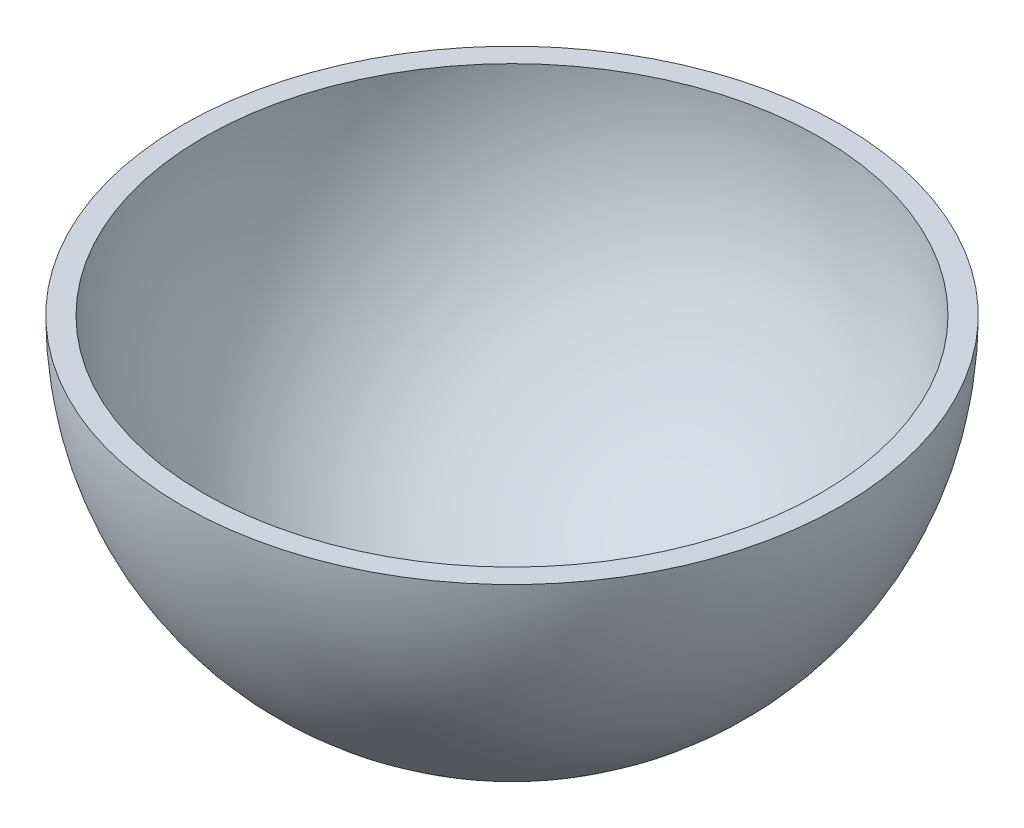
ISO-10303-21;
HEADER;
FILE_DESCRIPTION(('STEP AP214'),'2;1');
FILE_NAME('part.step','',(''),(''),'','','');
FILE_SCHEMA(('AUTOMOTIVE_DESIGN { 1 0 10303 214 1 1 1 1 }'));
ENDSEC;
DATA;
#1=APPLICATION_CONTEXT('core data for automotive mechanical design processes');
#2=APPLICATION_PROTOCOL_DEFINITION('international standard','automotive_design',2000,#1);
#3=PRODUCT_CONTEXT('',#1,'mechanical');
#4=PRODUCT('Part','Part','',(#3));
#5=PRODUCT_RELATED_PRODUCT_CATEGORY('part','',(#4));
#6=PRODUCT_DEFINITION_FORMATION('','',#4);
#7=PRODUCT_DEFINITION_CONTEXT('part definition',#1,'design');
#8=PRODUCT_DEFINITION('design','',#6,#7);
#9=PRODUCT_DEFINITION_SHAPE('','',#8);
#10=(LENGTH_UNIT() NAMED_UNIT(*) SI_UNIT(.MILLI.,.METRE.));
#11=(NAMED_UNIT(*) PLANE_ANGLE_UNIT() SI_UNIT($,.RADIAN.));
#12=(NAMED_UNIT(*) SI_UNIT($,.STERADIAN.) SOLID_ANGLE_UNIT());
#13=UNCERTAINTY_MEASURE_WITH_UNIT(LENGTH_MEASURE(1.E-05),#10,'distance_accuracy_value','');
#14=(GEOMETRIC_REPRESENTATION_CONTEXT(3) GLOBAL_UNCERTAINTY_ASSIGNED_CONTEXT((#13)) GLOBAL_UNIT_ASSIGNED_CONTEXT((#10,
#11,#12)) REPRESENTATION_CONTEXT('',''));
#15=CARTESIAN_POINT('',(0.,0.,0.));
#16=DIRECTION('',(0.,0.,1.));
#17=DIRECTION('',(1.,0.,0.));
#18=AXIS2_PLACEMENT_3D('',#15,#16,#17);
#19=CARTESIAN_POINT('',(0.,0.,0.));
#20=DIRECTION('',(0.,1.,0.));
#21=DIRECTION('',(-1.,0.,0.));
#22=AXIS2_PLACEMENT_3D('',#19,#20,#21);
#23=SPHERICAL_SURFACE('',#22,215.9);
#24=CARTESIAN_POINT('',(0.,0.,0.));
#25=DIRECTION('',(0.,1.,0.));
#26=DIRECTION('',(0.,0.,1.));
#27=AXIS2_PLACEMENT_3D('',#24,#25,#26);
#28=CIRCLE('',#27,215.9);
#29=CARTESIAN_POINT('',(0.,0.,215.9));
#30=VERTEX_POINT('',#29);
#31=EDGE_CURVE('E39',#30,#30,#28,.T.);
#32=ORIENTED_EDGE('',*,*,#31,.F.);
#33=EDGE_LOOP('',(#32));
#34=FACE_BOUND('',#33,.T.);
#35=CARTESIAN_POINT('',(0.,-195.481333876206,-91.1544430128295));
#36=DIRECTION('',(0.,0.906307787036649,0.422618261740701));
#37=DIRECTION('',(0.,-0.422618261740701,0.906307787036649));
#38=AXIS2_PLACEMENT_3D('',#35,#36,#37);
#39=CIRCLE('',#38,9.52500000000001);
#40=CARTESIAN_POINT('',(0.,-199.506772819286,-82.5218613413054));
#41=VERTEX_POINT('',#40);
#42=EDGE_CURVE('E48',#41,#41,#39,.T.);
#43=ORIENTED_EDGE('',*,*,#42,.T.);
#44=EDGE_LOOP('',(#43));
#45=FACE_BOUND('',#44,.T.);
#46=ADVANCED_FACE('F32',(#34,#45),#23,.T.);
#47=CARTESIAN_POINT('',(0.,0.,0.));
#48=DIRECTION('',(0.,1.,0.));
#49=DIRECTION('',(-1.,0.,0.));
#50=AXIS2_PLACEMENT_3D('',#47,#48,#49);
#51=SPHERICAL_SURFACE('',#50,201.9);
#52=CARTESIAN_POINT('',(0.,0.,0.));
#53=DIRECTION('',(0.,1.,0.));
#54=DIRECTION('',(0.,0.,1.));
#55=AXIS2_PLACEMENT_3D('',#52,#53,#54);
#56=CIRCLE('',#55,201.9);
#57=CARTESIAN_POINT('',(0.,0.,201.9));
#58=VERTEX_POINT('',#57);
#59=EDGE_CURVE('E10',#58,#58,#56,.T.);
#60=ORIENTED_EDGE('',*,*,#59,.T.);
#61=EDGE_LOOP('',(#60));
#62=FACE_BOUND('',#61,.T.);
#63=CARTESIAN_POINT('',(0.,-182.968623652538,-85.3196704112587));
#64=DIRECTION('',(0.,0.906307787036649,0.422618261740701));
#65=DIRECTION('',(0.,-0.422618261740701,0.906307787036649));
#66=AXIS2_PLACEMENT_3D('',#63,#64,#65);
#67=CIRCLE('',#66,2.57810000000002);
#68=CARTESIAN_POINT('',(0.,-184.058175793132,-82.9831183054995));
#69=VERTEX_POINT('',#68);
#70=EDGE_CURVE('E35',#69,#69,#67,.F.);
#71=ORIENTED_EDGE('',*,*,#70,.T.);
#72=EDGE_LOOP('',(#71));
#73=FACE_BOUND('',#72,.T.);
#74=ADVANCED_FACE('F65',(#62,#73),#51,.F.);
#75=CARTESIAN_POINT('',(-215.9,0.,0.));
#76=DIRECTION('',(0.,1.,0.));
#77=DIRECTION('',(0.,0.,1.));
#78=AXIS2_PLACEMENT_3D('',#75,#76,#77);
#79=PLANE('',#78);
#80=ORIENTED_EDGE('',*,*,#31,.T.);
#81=EDGE_LOOP('',(#80));
#82=FACE_BOUND('',#81,.T.);
#83=ORIENTED_EDGE('',*,*,#59,.F.);
#84=EDGE_LOOP('',(#83));
#85=FACE_BOUND('',#84,.T.);
#86=ADVANCED_FACE('F61',(#82,#85),#79,.T.);
#87=CARTESIAN_POINT('',(0.,0.,0.));
#88=DIRECTION('',(0.,0.906307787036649,0.422618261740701));
#89=DIRECTION('',(0.,-0.422618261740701,0.906307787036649));
#90=AXIS2_PLACEMENT_3D('',#87,#88,#89);
#91=CYLINDRICAL_SURFACE('',#90,2.57810000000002);
#92=ORIENTED_EDGE('',*,*,#70,.F.);
#93=EDGE_LOOP('',(#92));
#94=FACE_BOUND('',#93,.T.);
#95=CARTESIAN_POINT('',(0.,-195.481333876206,-91.1544430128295));
#96=DIRECTION('',(0.,0.906307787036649,0.422618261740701));
#97=DIRECTION('',(0.,-0.422618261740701,0.906307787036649));
#98=AXIS2_PLACEMENT_3D('',#95,#96,#97);
#99=CIRCLE('',#98,2.57810000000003);
#100=CARTESIAN_POINT('',(0.,-196.5708860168,-88.8178909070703));
#101=VERTEX_POINT('',#100);
#102=EDGE_CURVE('E45',#101,#101,#99,.T.);
#103=ORIENTED_EDGE('',*,*,#102,.F.);
#104=EDGE_LOOP('',(#103));
#105=FACE_BOUND('',#104,.T.);
#106=ADVANCED_FACE('F55',(#94,#105),#91,.F.);
#107=CARTESIAN_POINT('',(0.,-194.391781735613,-93.4909951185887));
#108=DIRECTION('',(0.,-0.906307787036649,-0.422618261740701));
#109=DIRECTION('',(0.,0.422618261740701,-0.906307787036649));
#110=AXIS2_PLACEMENT_3D('',#107,#108,#109);
#111=PLANE('',#110);
#112=ORIENTED_EDGE('',*,*,#102,.T.);
#113=EDGE_LOOP('',(#112));
#114=FACE_BOUND('',#113,.T.);
#115=ORIENTED_EDGE('',*,*,#42,.F.);
#116=EDGE_LOOP('',(#115));
#117=FACE_BOUND('',#116,.T.);
#118=ADVANCED_FACE('F53',(#114,#117),#111,.T.);
#119=CLOSED_SHELL('',(#46,#74,#86,#106,#118));
#120=MANIFOLD_SOLID_BREP('B2',#119);
#121=ADVANCED_BREP_SHAPE_REPRESENTATION('',(#18,#120),#14);
#122=SHAPE_DEFINITION_REPRESENTATION(#9,#121);
ENDSEC;
END-ISO-10303-21;
